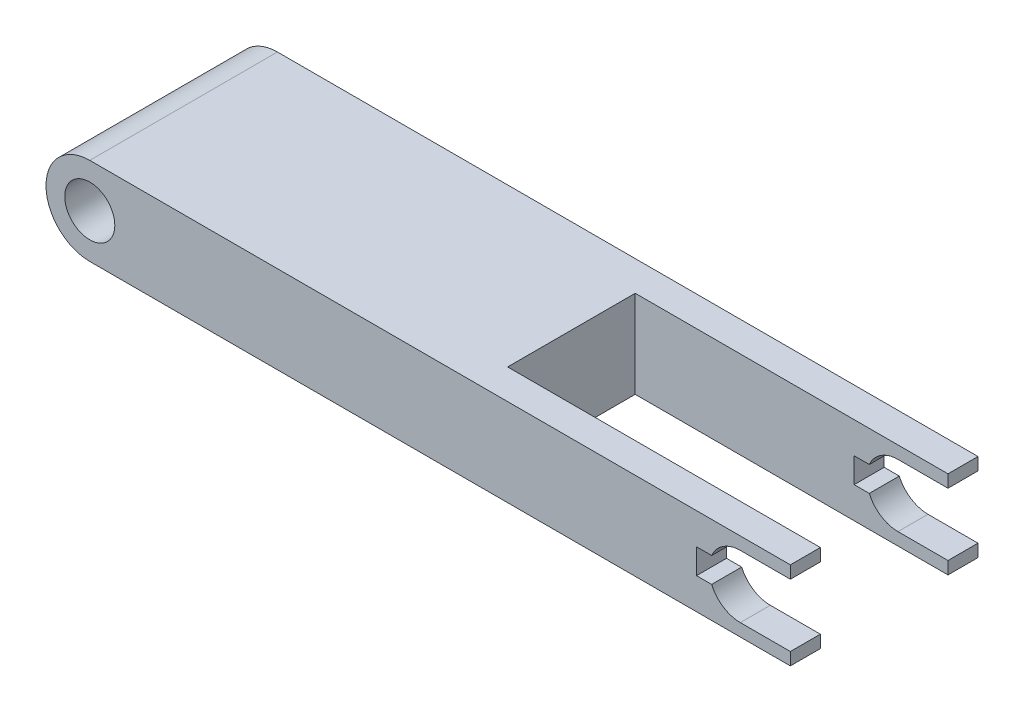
from build123d import *

# Parameters (mm, degrees)
SKETCH_1_W          = 52
SKETCH_1_H          = 7
EXTRUDE_1_DEPTH     = 7.5
CUT_EXTRUDE_1_DEPTH = 5.1
SKETCH_7_R          = 3.5
EXTRUDE_4_DEPTH     = 15
SKETCH_9_R          = 2.5
CUT_EXTRUDE_3_DEPTH = 34.279122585
SKETCH_11_W         = 2
SKETCH_11_H         = 2
CUT_EXTRUDE_5_DEPTH = 34.279122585
SKETCH_12_W         = 2.4
SKETCH_12_H         = 1
EXTRUDE_5_DEPTH     = 4
SKETCH_13_R         = 2
CUT_EXTRUDE_6_DEPTH = 34.723137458


with BuildPart() as part:
    # Sketch 1 → Extrude 1 (new, symmetric)
    with BuildSketch(Plane.XY):
        Rectangle(SKETCH_1_W, SKETCH_1_H)
    extrude(amount=EXTRUDE_1_DEPTH, both=True)

    # Sketch 3 → Cut-Extrude 1 (cut, symmetric)
    with BuildSketch(Plane.XY):
        with BuildLine():
            Line((5, -3.5), (26, -3.5))
            ThreePointArc((26, -3.5), (29.5, 0), (26, 3.5))
            Line((26, 3.5), (5, 3.5))
            Line((5, 3.5), (5, -3.5))
        make_face()
    extrude(amount=CUT_EXTRUDE_1_DEPTH, both=True, mode=Mode.SUBTRACT)

    # Sketch 7 → Extrude 4 (add)
    with BuildSketch(Plane.XY.offset(7.5)):
        with Locations((-26, 0)):
            Circle(SKETCH_7_R)
    extrude(amount=-EXTRUDE_4_DEPTH)

    # Sketch 9 → Cut-Extrude 3 (cut, through all)
    with BuildSketch(Plane.XY.offset(7.5)):
        with Locations((26, 0)):
            Circle(SKETCH_9_R)
    extrude(amount=-CUT_EXTRUDE_3_DEPTH, mode=Mode.SUBTRACT)

    # Sketch 11 → Cut-Extrude 5 (cut, through all)
    with BuildSketch(Plane.XY.offset(7.5)):
        with Locations((23.5, 0)):
            Rectangle(SKETCH_11_W, SKETCH_11_H)
    extrude(amount=-CUT_EXTRUDE_5_DEPTH, mode=Mode.SUBTRACT)

    # Sketch 12 → Extrude 5 (add)
    with BuildSketch(Plane(origin=(26, 0, 0), x_dir=(0, 0, -1), z_dir=(1, 0, 0))):
        with Locations((-6.3, 3)):
            Rectangle(SKETCH_12_W, SKETCH_12_H)
        with Locations((-6.3, -3)):
            Rectangle(SKETCH_12_W, SKETCH_12_H)
        with Locations((6.3, -3)):
            Rectangle(SKETCH_12_W, SKETCH_12_H)
        with Locations((6.3, 3)):
            Rectangle(SKETCH_12_W, SKETCH_12_H)
    extrude(amount=EXTRUDE_5_DEPTH)

    # Sketch 13 → Cut-Extrude 6 (cut, through all)
    with BuildSketch(Plane.XY.offset(7.5)):
        with Locations((-26, 0)):
            Circle(SKETCH_13_R)
    extrude(amount=-CUT_EXTRUDE_6_DEPTH, mode=Mode.SUBTRACT)


solid = part.part
